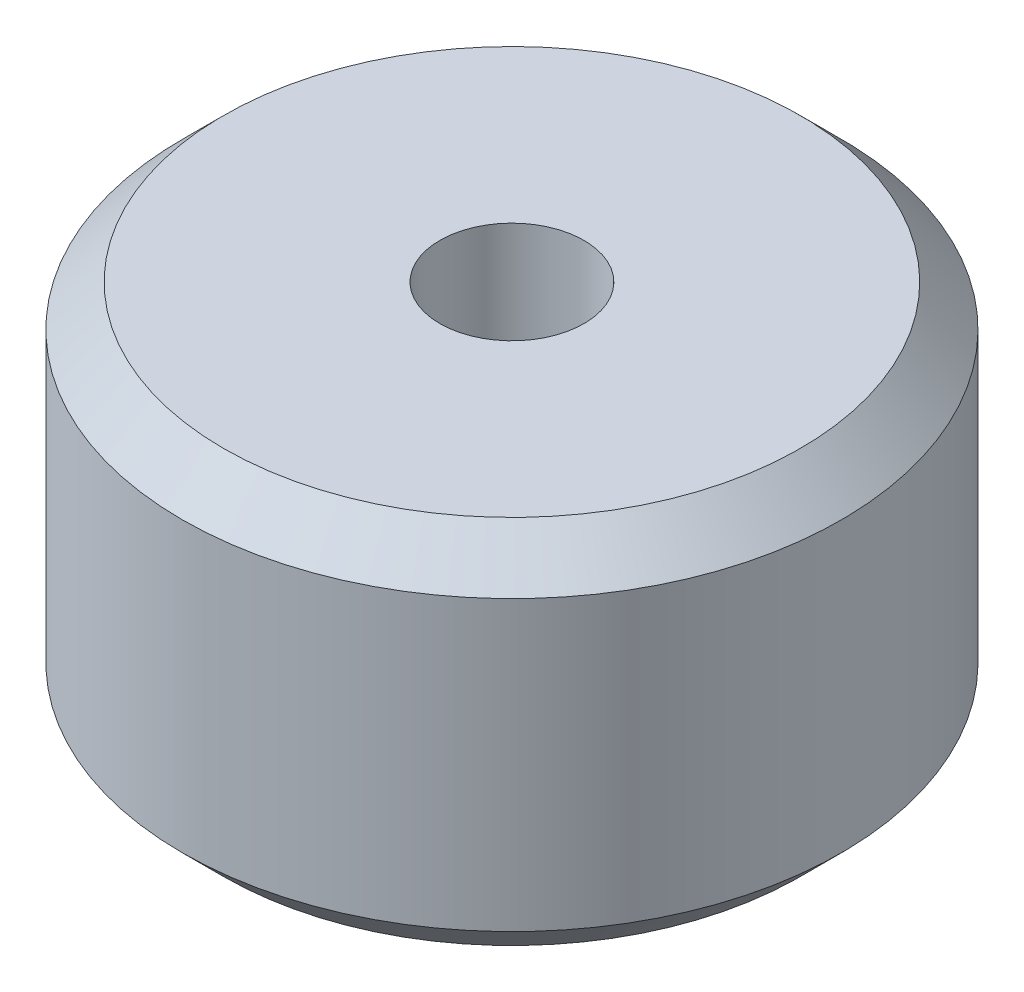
ISO-10303-21;
HEADER;
FILE_DESCRIPTION(('STEP AP214'),'2;1');
FILE_NAME('part.step','',(''),(''),'','','');
FILE_SCHEMA(('AUTOMOTIVE_DESIGN { 1 0 10303 214 1 1 1 1 }'));
ENDSEC;
DATA;
#1=APPLICATION_CONTEXT('core data for automotive mechanical design processes');
#2=APPLICATION_PROTOCOL_DEFINITION('international standard','automotive_design',2000,#1);
#3=PRODUCT_CONTEXT('',#1,'mechanical');
#4=PRODUCT('Part','Part','',(#3));
#5=PRODUCT_RELATED_PRODUCT_CATEGORY('part','',(#4));
#6=PRODUCT_DEFINITION_FORMATION('','',#4);
#7=PRODUCT_DEFINITION_CONTEXT('part definition',#1,'design');
#8=PRODUCT_DEFINITION('design','',#6,#7);
#9=PRODUCT_DEFINITION_SHAPE('','',#8);
#10=(LENGTH_UNIT() NAMED_UNIT(*) SI_UNIT(.MILLI.,.METRE.));
#11=(NAMED_UNIT(*) PLANE_ANGLE_UNIT() SI_UNIT($,.RADIAN.));
#12=(NAMED_UNIT(*) SI_UNIT($,.STERADIAN.) SOLID_ANGLE_UNIT());
#13=UNCERTAINTY_MEASURE_WITH_UNIT(LENGTH_MEASURE(1.E-05),#10,'distance_accuracy_value','');
#14=(GEOMETRIC_REPRESENTATION_CONTEXT(3) GLOBAL_UNCERTAINTY_ASSIGNED_CONTEXT((#13)) GLOBAL_UNIT_ASSIGNED_CONTEXT((#10,
#11,#12)) REPRESENTATION_CONTEXT('',''));
#15=CARTESIAN_POINT('',(0.,0.,0.));
#16=DIRECTION('',(0.,0.,1.));
#17=DIRECTION('',(1.,0.,0.));
#18=AXIS2_PLACEMENT_3D('',#15,#16,#17);
#19=CARTESIAN_POINT('',(0.,9.,0.));
#20=DIRECTION('',(0.,1.,0.));
#21=DIRECTION('',(0.,0.,1.));
#22=AXIS2_PLACEMENT_3D('',#19,#20,#21);
#23=PLANE('',#22);
#24=CARTESIAN_POINT('',(0.,9.,0.));
#25=DIRECTION('',(0.,1.,0.));
#26=DIRECTION('',(0.,0.,1.));
#27=AXIS2_PLACEMENT_3D('',#24,#25,#26);
#28=CIRCLE('',#27,7.);
#29=CARTESIAN_POINT('',(0.,9.,7.));
#30=VERTEX_POINT('',#29);
#31=EDGE_CURVE('E10',#30,#30,#28,.T.);
#32=ORIENTED_EDGE('',*,*,#31,.T.);
#33=EDGE_LOOP('',(#32));
#34=FACE_BOUND('',#33,.T.);
#35=CARTESIAN_POINT('',(0.,9.,0.));
#36=DIRECTION('',(0.,1.,0.));
#37=DIRECTION('',(0.,0.,1.));
#38=AXIS2_PLACEMENT_3D('',#35,#36,#37);
#39=CIRCLE('',#38,1.75);
#40=CARTESIAN_POINT('',(0.,9.,1.75));
#41=VERTEX_POINT('',#40);
#42=EDGE_CURVE('E48',#41,#41,#39,.T.);
#43=ORIENTED_EDGE('',*,*,#42,.F.);
#44=EDGE_LOOP('',(#43));
#45=FACE_BOUND('',#44,.T.);
#46=ADVANCED_FACE('F28',(#34,#45),#23,.T.);
#47=CARTESIAN_POINT('',(0.,0.,0.));
#48=DIRECTION('',(0.,1.,0.));
#49=DIRECTION('',(0.,0.,1.));
#50=AXIS2_PLACEMENT_3D('',#47,#48,#49);
#51=PLANE('',#50);
#52=CARTESIAN_POINT('',(0.,0.,0.));
#53=DIRECTION('',(0.,1.,0.));
#54=DIRECTION('',(0.,0.,1.));
#55=AXIS2_PLACEMENT_3D('',#52,#53,#54);
#56=CIRCLE('',#55,7.);
#57=CARTESIAN_POINT('',(0.,0.,7.));
#58=VERTEX_POINT('',#57);
#59=EDGE_CURVE('E35',#58,#58,#56,.F.);
#60=ORIENTED_EDGE('',*,*,#59,.T.);
#61=EDGE_LOOP('',(#60));
#62=FACE_BOUND('',#61,.T.);
#63=CARTESIAN_POINT('',(0.,0.,0.));
#64=DIRECTION('',(0.,1.,0.));
#65=DIRECTION('',(0.,0.,1.));
#66=AXIS2_PLACEMENT_3D('',#63,#64,#65);
#67=CIRCLE('',#66,1.75);
#68=CARTESIAN_POINT('',(0.,0.,1.75));
#69=VERTEX_POINT('',#68);
#70=EDGE_CURVE('E51',#69,#69,#67,.T.);
#71=ORIENTED_EDGE('',*,*,#70,.T.);
#72=EDGE_LOOP('',(#71));
#73=FACE_BOUND('',#72,.T.);
#74=ADVANCED_FACE('F55',(#62,#73),#51,.F.);
#75=CARTESIAN_POINT('',(0.,9.,0.));
#76=DIRECTION('',(0.,-1.,0.));
#77=DIRECTION('',(0.,0.,-1.));
#78=AXIS2_PLACEMENT_3D('',#75,#76,#77);
#79=CYLINDRICAL_SURFACE('',#78,8.);
#80=CARTESIAN_POINT('',(0.,1.,0.));
#81=DIRECTION('',(0.,1.,0.));
#82=DIRECTION('',(0.,0.,1.));
#83=AXIS2_PLACEMENT_3D('',#80,#81,#82);
#84=CIRCLE('',#83,8.);
#85=CARTESIAN_POINT('',(0.,1.,8.));
#86=VERTEX_POINT('',#85);
#87=EDGE_CURVE('E39',#86,#86,#84,.T.);
#88=ORIENTED_EDGE('',*,*,#87,.T.);
#89=EDGE_LOOP('',(#88));
#90=FACE_BOUND('',#89,.T.);
#91=CARTESIAN_POINT('',(0.,8.,0.));
#92=DIRECTION('',(0.,1.,0.));
#93=DIRECTION('',(0.,0.,1.));
#94=AXIS2_PLACEMENT_3D('',#91,#92,#93);
#95=CIRCLE('',#94,8.);
#96=CARTESIAN_POINT('',(0.,8.,8.));
#97=VERTEX_POINT('',#96);
#98=EDGE_CURVE('E43',#97,#97,#95,.F.);
#99=ORIENTED_EDGE('',*,*,#98,.T.);
#100=EDGE_LOOP('',(#99));
#101=FACE_BOUND('',#100,.T.);
#102=ADVANCED_FACE('F30',(#90,#101),#79,.T.);
#103=CARTESIAN_POINT('',(0.,9.,0.));
#104=DIRECTION('',(0.,-1.,0.));
#105=DIRECTION('',(0.,0.,-1.));
#106=AXIS2_PLACEMENT_3D('',#103,#104,#105);
#107=CYLINDRICAL_SURFACE('',#106,1.75);
#108=ORIENTED_EDGE('',*,*,#42,.T.);
#109=EDGE_LOOP('',(#108));
#110=FACE_BOUND('',#109,.T.);
#111=ORIENTED_EDGE('',*,*,#70,.F.);
#112=EDGE_LOOP('',(#111));
#113=FACE_BOUND('',#112,.T.);
#114=ADVANCED_FACE('F57',(#110,#113),#107,.F.);
#115=CARTESIAN_POINT('',(0.,1.,0.));
#116=DIRECTION('',(0.,1.,0.));
#117=DIRECTION('',(0.,0.,1.));
#118=AXIS2_PLACEMENT_3D('',#115,#116,#117);
#119=CONICAL_SURFACE('',#118,8.,0.78539816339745);
#120=ORIENTED_EDGE('',*,*,#59,.F.);
#121=EDGE_LOOP('',(#120));
#122=FACE_BOUND('',#121,.T.);
#123=ORIENTED_EDGE('',*,*,#87,.F.);
#124=EDGE_LOOP('',(#123));
#125=FACE_BOUND('',#124,.T.);
#126=ADVANCED_FACE('F59',(#122,#125),#119,.T.);
#127=CARTESIAN_POINT('',(0.,9.,0.));
#128=DIRECTION('',(0.,-1.,0.));
#129=DIRECTION('',(0.,0.,-1.));
#130=AXIS2_PLACEMENT_3D('',#127,#128,#129);
#131=CONICAL_SURFACE('',#130,7.,0.785398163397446);
#132=ORIENTED_EDGE('',*,*,#98,.F.);
#133=EDGE_LOOP('',(#132));
#134=FACE_BOUND('',#133,.T.);
#135=ORIENTED_EDGE('',*,*,#31,.F.);
#136=EDGE_LOOP('',(#135));
#137=FACE_BOUND('',#136,.T.);
#138=ADVANCED_FACE('F66',(#134,#137),#131,.T.);
#139=CLOSED_SHELL('',(#46,#74,#102,#114,#126,#138));
#140=MANIFOLD_SOLID_BREP('B2',#139);
#141=ADVANCED_BREP_SHAPE_REPRESENTATION('',(#18,#140),#14);
#142=SHAPE_DEFINITION_REPRESENTATION(#9,#141);
ENDSEC;
END-ISO-10303-21;
